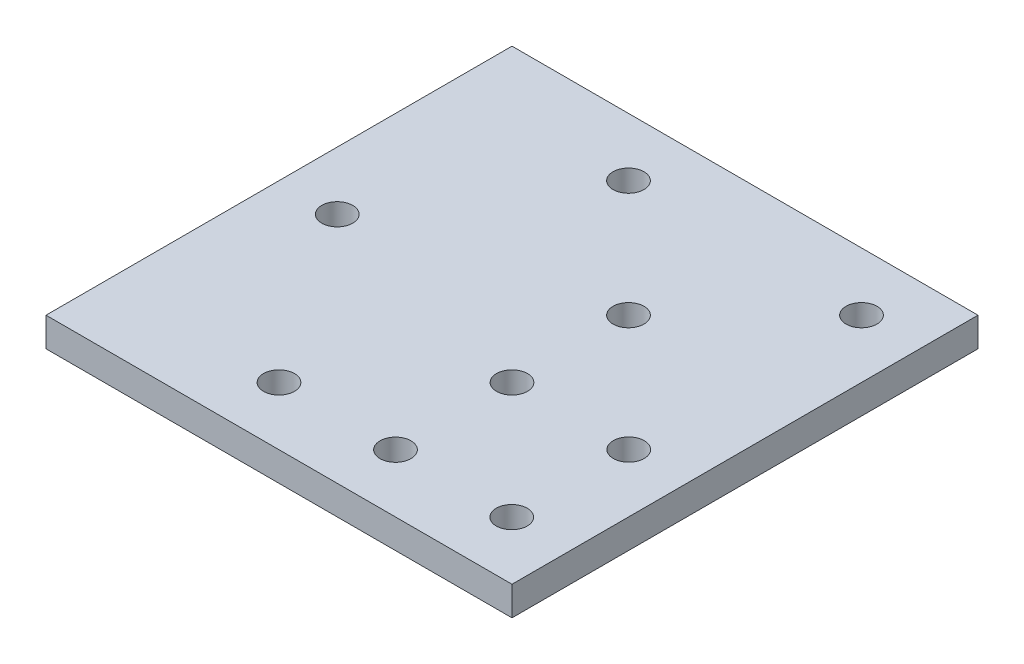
ISO-10303-21;
HEADER;
FILE_DESCRIPTION(('STEP AP214'),'2;1');
FILE_NAME('part.step','',(''),(''),'','','');
FILE_SCHEMA(('AUTOMOTIVE_DESIGN { 1 0 10303 214 1 1 1 1 }'));
ENDSEC;
DATA;
#1=APPLICATION_CONTEXT('core data for automotive mechanical design processes');
#2=APPLICATION_PROTOCOL_DEFINITION('international standard','automotive_design',2000,#1);
#3=PRODUCT_CONTEXT('',#1,'mechanical');
#4=PRODUCT('Part','Part','',(#3));
#5=PRODUCT_RELATED_PRODUCT_CATEGORY('part','',(#4));
#6=PRODUCT_DEFINITION_FORMATION('','',#4);
#7=PRODUCT_DEFINITION_CONTEXT('part definition',#1,'design');
#8=PRODUCT_DEFINITION('design','',#6,#7);
#9=PRODUCT_DEFINITION_SHAPE('','',#8);
#10=(LENGTH_UNIT() NAMED_UNIT(*) SI_UNIT(.MILLI.,.METRE.));
#11=(NAMED_UNIT(*) PLANE_ANGLE_UNIT() SI_UNIT($,.RADIAN.));
#12=(NAMED_UNIT(*) SI_UNIT($,.STERADIAN.) SOLID_ANGLE_UNIT());
#13=UNCERTAINTY_MEASURE_WITH_UNIT(LENGTH_MEASURE(1.E-05),#10,'distance_accuracy_value','');
#14=(GEOMETRIC_REPRESENTATION_CONTEXT(3) GLOBAL_UNCERTAINTY_ASSIGNED_CONTEXT((#13)) GLOBAL_UNIT_ASSIGNED_CONTEXT((#10,
#11,#12)) REPRESENTATION_CONTEXT('',''));
#15=CARTESIAN_POINT('',(0.,0.,0.));
#16=DIRECTION('',(0.,0.,1.));
#17=DIRECTION('',(1.,0.,0.));
#18=AXIS2_PLACEMENT_3D('',#15,#16,#17);
#19=CARTESIAN_POINT('',(0.,6.34999999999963,-101.6));
#20=DIRECTION('',(0.,-1.,0.));
#21=DIRECTION('',(0.,0.,-1.));
#22=AXIS2_PLACEMENT_3D('',#19,#20,#21);
#23=PLANE('',#22);
#24=CARTESIAN_POINT('',(38.1,6.34999999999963,-88.9));
#25=DIRECTION('',(0.,1.,0.));
#26=DIRECTION('',(0.,0.,-1.));
#27=AXIS2_PLACEMENT_3D('',#24,#25,#26);
#28=CIRCLE('',#27,3.37311999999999);
#29=CARTESIAN_POINT('',(38.1,6.34999999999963,-92.27312));
#30=VERTEX_POINT('',#29);
#31=EDGE_CURVE('E174',#30,#30,#28,.T.);
#32=ORIENTED_EDGE('',*,*,#31,.F.);
#33=EDGE_LOOP('',(#32));
#34=FACE_BOUND('',#33,.T.);
#35=CARTESIAN_POINT('',(88.9,6.35000000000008,-12.6465638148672));
#36=DIRECTION('',(0.,1.,0.));
#37=DIRECTION('',(0.,0.,-1.));
#38=AXIS2_PLACEMENT_3D('',#35,#36,#37);
#39=CIRCLE('',#38,3.37312000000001);
#40=CARTESIAN_POINT('',(88.9,6.35000000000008,-16.0196838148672));
#41=VERTEX_POINT('',#40);
#42=EDGE_CURVE('E186',#41,#41,#39,.T.);
#43=ORIENTED_EDGE('',*,*,#42,.F.);
#44=EDGE_LOOP('',(#43));
#45=FACE_BOUND('',#44,.T.);
#46=CARTESIAN_POINT('',(88.9,6.34999999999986,-88.8999999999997));
#47=DIRECTION('',(0.,1.,0.));
#48=DIRECTION('',(0.,0.,1.));
#49=AXIS2_PLACEMENT_3D('',#46,#47,#48);
#50=CIRCLE('',#49,3.37311999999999);
#51=CARTESIAN_POINT('',(88.9,6.34999999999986,-85.5268799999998));
#52=VERTEX_POINT('',#51);
#53=EDGE_CURVE('E198',#52,#52,#50,.T.);
#54=ORIENTED_EDGE('',*,*,#53,.F.);
#55=EDGE_LOOP('',(#54));
#56=FACE_BOUND('',#55,.T.);
#57=CARTESIAN_POINT('',(38.1,6.34999999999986,-12.6999999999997));
#58=DIRECTION('',(0.,1.,0.));
#59=DIRECTION('',(0.,0.,-1.));
#60=AXIS2_PLACEMENT_3D('',#57,#58,#59);
#61=CIRCLE('',#60,3.37312);
#62=CARTESIAN_POINT('',(38.1,6.34999999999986,-16.0731199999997));
#63=VERTEX_POINT('',#62);
#64=EDGE_CURVE('E210',#63,#63,#61,.T.);
#65=ORIENTED_EDGE('',*,*,#64,.F.);
#66=EDGE_LOOP('',(#65));
#67=FACE_BOUND('',#66,.T.);
#68=DIRECTION('',(0.,0.,1.));
#69=VECTOR('',#68,1.);
#70=CARTESIAN_POINT('',(0.,6.34999999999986,0.));
#71=LINE('',#70,#69);
#72=CARTESIAN_POINT('',(0.,6.34999999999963,-101.6));
#73=VERTEX_POINT('',#72);
#74=CARTESIAN_POINT('',(0.,6.34999999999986,0.));
#75=VERTEX_POINT('',#74);
#76=EDGE_CURVE('E47',#73,#75,#71,.T.);
#77=ORIENTED_EDGE('',*,*,#76,.T.);
#78=DIRECTION('',(1.,0.,0.));
#79=VECTOR('',#78,1.);
#80=CARTESIAN_POINT('',(0.,6.34999999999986,0.));
#81=LINE('',#80,#79);
#82=CARTESIAN_POINT('',(101.6,6.34999999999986,2.22044604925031E-13));
#83=VERTEX_POINT('',#82);
#84=EDGE_CURVE('E77',#75,#83,#81,.T.);
#85=ORIENTED_EDGE('',*,*,#84,.T.);
#86=DIRECTION('',(0.,0.,-1.));
#87=VECTOR('',#86,1.);
#88=CARTESIAN_POINT('',(101.6,6.34999999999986,2.22044604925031E-13));
#89=LINE('',#88,#87);
#90=CARTESIAN_POINT('',(101.6,6.34999999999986,-101.6));
#91=VERTEX_POINT('',#90);
#92=EDGE_CURVE('E81',#83,#91,#89,.T.);
#93=ORIENTED_EDGE('',*,*,#92,.T.);
#94=DIRECTION('',(-1.,0.,0.));
#95=VECTOR('',#94,1.);
#96=CARTESIAN_POINT('',(0.,6.34999999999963,-101.6));
#97=LINE('',#96,#95);
#98=EDGE_CURVE('E89',#91,#73,#97,.T.);
#99=ORIENTED_EDGE('',*,*,#98,.T.);
#100=EDGE_LOOP('',(#77,#85,#93,#99));
#101=FACE_BOUND('',#100,.T.);
#102=CARTESIAN_POINT('',(88.9000000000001,6.34999999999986,-38.1534361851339));
#103=DIRECTION('',(0.,1.,0.));
#104=DIRECTION('',(0.,0.,1.));
#105=AXIS2_PLACEMENT_3D('',#102,#103,#104);
#106=CIRCLE('',#105,3.37312000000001);
#107=CARTESIAN_POINT('',(88.9000000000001,6.34999999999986,-34.7803161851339));
#108=VERTEX_POINT('',#107);
#109=EDGE_CURVE('E96',#108,#108,#106,.T.);
#110=ORIENTED_EDGE('',*,*,#109,.F.);
#111=EDGE_LOOP('',(#110));
#112=FACE_BOUND('',#111,.T.);
#113=CARTESIAN_POINT('',(63.5000000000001,6.35000000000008,-12.6999999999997));
#114=DIRECTION('',(0.,1.,0.));
#115=DIRECTION('',(0.,0.,1.));
#116=AXIS2_PLACEMENT_3D('',#113,#114,#115);
#117=CIRCLE('',#116,3.37312);
#118=CARTESIAN_POINT('',(63.5000000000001,6.35000000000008,-9.32687999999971));
#119=VERTEX_POINT('',#118);
#120=EDGE_CURVE('E204',#119,#119,#117,.T.);
#121=ORIENTED_EDGE('',*,*,#120,.F.);
#122=EDGE_LOOP('',(#121));
#123=FACE_BOUND('',#122,.T.);
#124=CARTESIAN_POINT('',(63.5000000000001,6.34999999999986,-63.5000000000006));
#125=DIRECTION('',(0.,1.,0.));
#126=DIRECTION('',(0.,0.,1.));
#127=AXIS2_PLACEMENT_3D('',#124,#125,#126);
#128=CIRCLE('',#127,3.37311999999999);
#129=CARTESIAN_POINT('',(63.5000000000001,6.34999999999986,-60.1268800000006));
#130=VERTEX_POINT('',#129);
#131=EDGE_CURVE('E192',#130,#130,#128,.T.);
#132=ORIENTED_EDGE('',*,*,#131,.F.);
#133=EDGE_LOOP('',(#132));
#134=FACE_BOUND('',#133,.T.);
#135=CARTESIAN_POINT('',(63.5,6.34999999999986,-38.1000000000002));
#136=DIRECTION('',(0.,1.,0.));
#137=DIRECTION('',(0.,0.,-1.));
#138=AXIS2_PLACEMENT_3D('',#135,#136,#137);
#139=CIRCLE('',#138,3.37311999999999);
#140=CARTESIAN_POINT('',(63.5,6.34999999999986,-41.4731200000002));
#141=VERTEX_POINT('',#140);
#142=EDGE_CURVE('E180',#141,#141,#139,.T.);
#143=ORIENTED_EDGE('',*,*,#142,.F.);
#144=EDGE_LOOP('',(#143));
#145=FACE_BOUND('',#144,.T.);
#146=CARTESIAN_POINT('',(12.7,6.34999999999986,-50.8));
#147=DIRECTION('',(0.,1.,0.));
#148=DIRECTION('',(0.,0.,-1.));
#149=AXIS2_PLACEMENT_3D('',#146,#147,#148);
#150=CIRCLE('',#149,3.37312);
#151=CARTESIAN_POINT('',(12.7,6.34999999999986,-54.17312));
#152=VERTEX_POINT('',#151);
#153=EDGE_CURVE('E165',#152,#152,#150,.T.);
#154=ORIENTED_EDGE('',*,*,#153,.F.);
#155=EDGE_LOOP('',(#154));
#156=FACE_BOUND('',#155,.T.);
#157=ADVANCED_FACE('F30',(#34,#45,#56,#67,#101,#112,#123,#134,#145,#156),#23,.F.);
#158=CARTESIAN_POINT('',(0.,-2.22044604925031E-13,-101.6));
#159=DIRECTION('',(0.,-1.,0.));
#160=DIRECTION('',(0.,0.,-1.));
#161=AXIS2_PLACEMENT_3D('',#158,#159,#160);
#162=PLANE('',#161);
#163=CARTESIAN_POINT('',(38.1,-2.22044604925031E-13,-88.9));
#164=DIRECTION('',(0.,1.,0.));
#165=DIRECTION('',(0.,0.,-1.));
#166=AXIS2_PLACEMENT_3D('',#163,#164,#165);
#167=CIRCLE('',#166,3.37311999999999);
#168=CARTESIAN_POINT('',(38.1,-2.22138145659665E-13,-92.27312));
#169=VERTEX_POINT('',#168);
#170=EDGE_CURVE('E171',#169,#169,#167,.T.);
#171=ORIENTED_EDGE('',*,*,#170,.T.);
#172=EDGE_LOOP('',(#171));
#173=FACE_BOUND('',#172,.T.);
#174=CARTESIAN_POINT('',(88.9,0.,-12.6465638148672));
#175=DIRECTION('',(0.,1.,0.));
#176=DIRECTION('',(0.,0.,-1.));
#177=AXIS2_PLACEMENT_3D('',#174,#175,#176);
#178=CIRCLE('',#177,3.37312000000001);
#179=CARTESIAN_POINT('',(88.9,0.,-16.0196838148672));
#180=VERTEX_POINT('',#179);
#181=EDGE_CURVE('E183',#180,#180,#178,.T.);
#182=ORIENTED_EDGE('',*,*,#181,.T.);
#183=EDGE_LOOP('',(#182));
#184=FACE_BOUND('',#183,.T.);
#185=CARTESIAN_POINT('',(88.9,0.,-88.8999999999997));
#186=DIRECTION('',(0.,1.,0.));
#187=DIRECTION('',(0.,0.,1.));
#188=AXIS2_PLACEMENT_3D('',#185,#186,#187);
#189=CIRCLE('',#188,3.37311999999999);
#190=CARTESIAN_POINT('',(88.9,0.,-85.5268799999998));
#191=VERTEX_POINT('',#190);
#192=EDGE_CURVE('E195',#191,#191,#189,.T.);
#193=ORIENTED_EDGE('',*,*,#192,.T.);
#194=EDGE_LOOP('',(#193));
#195=FACE_BOUND('',#194,.T.);
#196=CARTESIAN_POINT('',(38.1,-2.22044604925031E-13,-12.6999999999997));
#197=DIRECTION('',(0.,1.,0.));
#198=DIRECTION('',(0.,0.,-1.));
#199=AXIS2_PLACEMENT_3D('',#196,#197,#198);
#200=CIRCLE('',#199,3.37312);
#201=CARTESIAN_POINT('',(38.1,-2.22138145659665E-13,-16.0731199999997));
#202=VERTEX_POINT('',#201);
#203=EDGE_CURVE('E207',#202,#202,#200,.T.);
#204=ORIENTED_EDGE('',*,*,#203,.T.);
#205=EDGE_LOOP('',(#204));
#206=FACE_BOUND('',#205,.T.);
#207=DIRECTION('',(1.,0.,0.));
#208=VECTOR('',#207,1.);
#209=CARTESIAN_POINT('',(0.,-2.22044604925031E-13,0.));
#210=LINE('',#209,#208);
#211=CARTESIAN_POINT('',(0.,-2.22044604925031E-13,0.));
#212=VERTEX_POINT('',#211);
#213=CARTESIAN_POINT('',(101.6,0.,2.22044604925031E-13));
#214=VERTEX_POINT('',#213);
#215=EDGE_CURVE('E85',#212,#214,#210,.T.);
#216=ORIENTED_EDGE('',*,*,#215,.F.);
#217=DIRECTION('',(0.,0.,1.));
#218=VECTOR('',#217,1.);
#219=CARTESIAN_POINT('',(0.,-2.22044604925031E-13,-50.7999999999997));
#220=LINE('',#219,#218);
#221=CARTESIAN_POINT('',(0.,-2.22044604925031E-13,-101.6));
#222=VERTEX_POINT('',#221);
#223=EDGE_CURVE('E99',#222,#212,#220,.T.);
#224=ORIENTED_EDGE('',*,*,#223,.F.);
#225=DIRECTION('',(-1.,0.,0.));
#226=VECTOR('',#225,1.);
#227=CARTESIAN_POINT('',(0.,-2.22044604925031E-13,-101.6));
#228=LINE('',#227,#226);
#229=CARTESIAN_POINT('',(101.6,-2.22044604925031E-13,-101.6));
#230=VERTEX_POINT('',#229);
#231=EDGE_CURVE('E71',#230,#222,#228,.T.);
#232=ORIENTED_EDGE('',*,*,#231,.F.);
#233=DIRECTION('',(0.,0.,-1.));
#234=VECTOR('',#233,1.);
#235=CARTESIAN_POINT('',(101.6,0.,-50.7999999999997));
#236=LINE('',#235,#234);
#237=EDGE_CURVE('E64',#214,#230,#236,.T.);
#238=ORIENTED_EDGE('',*,*,#237,.F.);
#239=EDGE_LOOP('',(#216,#224,#232,#238));
#240=FACE_BOUND('',#239,.T.);
#241=CARTESIAN_POINT('',(88.9000000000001,0.,-38.1534361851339));
#242=DIRECTION('',(0.,1.,0.));
#243=DIRECTION('',(0.,0.,1.));
#244=AXIS2_PLACEMENT_3D('',#241,#242,#243);
#245=CIRCLE('',#244,3.37312000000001);
#246=CARTESIAN_POINT('',(88.9000000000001,0.,-34.7803161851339));
#247=VERTEX_POINT('',#246);
#248=EDGE_CURVE('E213',#247,#247,#245,.T.);
#249=ORIENTED_EDGE('',*,*,#248,.T.);
#250=EDGE_LOOP('',(#249));
#251=FACE_BOUND('',#250,.T.);
#252=CARTESIAN_POINT('',(63.5000000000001,0.,-12.6999999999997));
#253=DIRECTION('',(0.,1.,0.));
#254=DIRECTION('',(0.,0.,1.));
#255=AXIS2_PLACEMENT_3D('',#252,#253,#254);
#256=CIRCLE('',#255,3.37312);
#257=CARTESIAN_POINT('',(63.5000000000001,0.,-9.32687999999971));
#258=VERTEX_POINT('',#257);
#259=EDGE_CURVE('E201',#258,#258,#256,.T.);
#260=ORIENTED_EDGE('',*,*,#259,.T.);
#261=EDGE_LOOP('',(#260));
#262=FACE_BOUND('',#261,.T.);
#263=CARTESIAN_POINT('',(63.5000000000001,0.,-63.5000000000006));
#264=DIRECTION('',(0.,1.,0.));
#265=DIRECTION('',(0.,0.,1.));
#266=AXIS2_PLACEMENT_3D('',#263,#264,#265);
#267=CIRCLE('',#266,3.37311999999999);
#268=CARTESIAN_POINT('',(63.5000000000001,0.,-60.1268800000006));
#269=VERTEX_POINT('',#268);
#270=EDGE_CURVE('E189',#269,#269,#267,.T.);
#271=ORIENTED_EDGE('',*,*,#270,.T.);
#272=EDGE_LOOP('',(#271));
#273=FACE_BOUND('',#272,.T.);
#274=CARTESIAN_POINT('',(63.5,0.,-38.1000000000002));
#275=DIRECTION('',(0.,1.,0.));
#276=DIRECTION('',(0.,0.,-1.));
#277=AXIS2_PLACEMENT_3D('',#274,#275,#276);
#278=CIRCLE('',#277,3.37311999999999);
#279=CARTESIAN_POINT('',(63.5,0.,-41.4731200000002));
#280=VERTEX_POINT('',#279);
#281=EDGE_CURVE('E177',#280,#280,#278,.T.);
#282=ORIENTED_EDGE('',*,*,#281,.T.);
#283=EDGE_LOOP('',(#282));
#284=FACE_BOUND('',#283,.T.);
#285=CARTESIAN_POINT('',(12.7,-2.22044604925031E-13,-50.8));
#286=DIRECTION('',(0.,1.,0.));
#287=DIRECTION('',(0.,0.,-1.));
#288=AXIS2_PLACEMENT_3D('',#285,#286,#287);
#289=CIRCLE('',#288,3.37312);
#290=CARTESIAN_POINT('',(12.7,-2.22138145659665E-13,-54.17312));
#291=VERTEX_POINT('',#290);
#292=EDGE_CURVE('E168',#291,#291,#289,.T.);
#293=ORIENTED_EDGE('',*,*,#292,.T.);
#294=EDGE_LOOP('',(#293));
#295=FACE_BOUND('',#294,.T.);
#296=ADVANCED_FACE('F105',(#173,#184,#195,#206,#240,#251,#262,#273,#284,#295),#162,.T.);
#297=CARTESIAN_POINT('',(0.,6.34999999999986,0.));
#298=DIRECTION('',(0.,0.,-1.));
#299=DIRECTION('',(-1.,0.,0.));
#300=AXIS2_PLACEMENT_3D('',#297,#298,#299);
#301=PLANE('',#300);
#302=ORIENTED_EDGE('',*,*,#215,.T.);
#303=DIRECTION('',(0.,-1.,0.));
#304=VECTOR('',#303,1.);
#305=CARTESIAN_POINT('',(101.6,6.34999999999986,2.22044604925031E-13));
#306=LINE('',#305,#304);
#307=EDGE_CURVE('E39',#83,#214,#306,.T.);
#308=ORIENTED_EDGE('',*,*,#307,.F.);
#309=ORIENTED_EDGE('',*,*,#84,.F.);
#310=DIRECTION('',(0.,-1.,0.));
#311=VECTOR('',#310,1.);
#312=CARTESIAN_POINT('',(0.,6.34999999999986,0.));
#313=LINE('',#312,#311);
#314=EDGE_CURVE('E11',#75,#212,#313,.T.);
#315=ORIENTED_EDGE('',*,*,#314,.T.);
#316=EDGE_LOOP('',(#302,#308,#309,#315));
#317=FACE_BOUND('',#316,.T.);
#318=ADVANCED_FACE('F32',(#317),#301,.F.);
#319=CARTESIAN_POINT('',(101.6,6.34999999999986,-50.7999999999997));
#320=DIRECTION('',(-1.,0.,0.));
#321=DIRECTION('',(0.,0.,1.));
#322=AXIS2_PLACEMENT_3D('',#319,#320,#321);
#323=PLANE('',#322);
#324=ORIENTED_EDGE('',*,*,#237,.T.);
#325=DIRECTION('',(0.,-1.,0.));
#326=VECTOR('',#325,1.);
#327=CARTESIAN_POINT('',(101.6,6.34999999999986,-101.6));
#328=LINE('',#327,#326);
#329=EDGE_CURVE('E86',#91,#230,#328,.T.);
#330=ORIENTED_EDGE('',*,*,#329,.F.);
#331=ORIENTED_EDGE('',*,*,#92,.F.);
#332=ORIENTED_EDGE('',*,*,#307,.T.);
#333=EDGE_LOOP('',(#324,#330,#331,#332));
#334=FACE_BOUND('',#333,.T.);
#335=ADVANCED_FACE('F87',(#334),#323,.F.);
#336=CARTESIAN_POINT('',(0.,6.34999999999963,-101.6));
#337=DIRECTION('',(0.,0.,1.));
#338=DIRECTION('',(1.,0.,0.));
#339=AXIS2_PLACEMENT_3D('',#336,#337,#338);
#340=PLANE('',#339);
#341=ORIENTED_EDGE('',*,*,#231,.T.);
#342=DIRECTION('',(0.,-1.,0.));
#343=VECTOR('',#342,1.);
#344=CARTESIAN_POINT('',(0.,6.34999999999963,-101.6));
#345=LINE('',#344,#343);
#346=EDGE_CURVE('E91',#73,#222,#345,.T.);
#347=ORIENTED_EDGE('',*,*,#346,.F.);
#348=ORIENTED_EDGE('',*,*,#98,.F.);
#349=ORIENTED_EDGE('',*,*,#329,.T.);
#350=EDGE_LOOP('',(#341,#347,#348,#349));
#351=FACE_BOUND('',#350,.T.);
#352=ADVANCED_FACE('F102',(#351),#340,.F.);
#353=CARTESIAN_POINT('',(0.,6.34999999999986,-50.7999999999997));
#354=DIRECTION('',(1.,0.,0.));
#355=DIRECTION('',(0.,0.,-1.));
#356=AXIS2_PLACEMENT_3D('',#353,#354,#355);
#357=PLANE('',#356);
#358=ORIENTED_EDGE('',*,*,#223,.T.);
#359=ORIENTED_EDGE('',*,*,#314,.F.);
#360=ORIENTED_EDGE('',*,*,#76,.F.);
#361=ORIENTED_EDGE('',*,*,#346,.T.);
#362=EDGE_LOOP('',(#358,#359,#360,#361));
#363=FACE_BOUND('',#362,.T.);
#364=ADVANCED_FACE('F107',(#363),#357,.F.);
#365=CARTESIAN_POINT('',(88.9000000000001,6.34999999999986,-38.1534361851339));
#366=DIRECTION('',(0.,-1.,0.));
#367=DIRECTION('',(0.,0.,-1.));
#368=AXIS2_PLACEMENT_3D('',#365,#366,#367);
#369=CYLINDRICAL_SURFACE('',#368,3.37312000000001);
#370=ORIENTED_EDGE('',*,*,#109,.T.);
#371=EDGE_LOOP('',(#370));
#372=FACE_BOUND('',#371,.T.);
#373=ORIENTED_EDGE('',*,*,#248,.F.);
#374=EDGE_LOOP('',(#373));
#375=FACE_BOUND('',#374,.T.);
#376=ADVANCED_FACE('F109',(#372,#375),#369,.F.);
#377=CARTESIAN_POINT('',(38.1,6.34999999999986,-12.6999999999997));
#378=DIRECTION('',(0.,-1.,0.));
#379=DIRECTION('',(0.,0.,-1.));
#380=AXIS2_PLACEMENT_3D('',#377,#378,#379);
#381=CYLINDRICAL_SURFACE('',#380,3.37312);
#382=ORIENTED_EDGE('',*,*,#64,.T.);
#383=EDGE_LOOP('',(#382));
#384=FACE_BOUND('',#383,.T.);
#385=ORIENTED_EDGE('',*,*,#203,.F.);
#386=EDGE_LOOP('',(#385));
#387=FACE_BOUND('',#386,.T.);
#388=ADVANCED_FACE('F115',(#384,#387),#381,.F.);
#389=CARTESIAN_POINT('',(63.5000000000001,6.35000000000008,-12.6999999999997));
#390=DIRECTION('',(0.,-1.,0.));
#391=DIRECTION('',(0.,0.,-1.));
#392=AXIS2_PLACEMENT_3D('',#389,#390,#391);
#393=CYLINDRICAL_SURFACE('',#392,3.37312);
#394=ORIENTED_EDGE('',*,*,#120,.T.);
#395=EDGE_LOOP('',(#394));
#396=FACE_BOUND('',#395,.T.);
#397=ORIENTED_EDGE('',*,*,#259,.F.);
#398=EDGE_LOOP('',(#397));
#399=FACE_BOUND('',#398,.T.);
#400=ADVANCED_FACE('F132',(#396,#399),#393,.F.);
#401=CARTESIAN_POINT('',(88.9,6.34999999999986,-88.8999999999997));
#402=DIRECTION('',(0.,-1.,0.));
#403=DIRECTION('',(0.,0.,-1.));
#404=AXIS2_PLACEMENT_3D('',#401,#402,#403);
#405=CYLINDRICAL_SURFACE('',#404,3.37311999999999);
#406=ORIENTED_EDGE('',*,*,#53,.T.);
#407=EDGE_LOOP('',(#406));
#408=FACE_BOUND('',#407,.T.);
#409=ORIENTED_EDGE('',*,*,#192,.F.);
#410=EDGE_LOOP('',(#409));
#411=FACE_BOUND('',#410,.T.);
#412=ADVANCED_FACE('F136',(#408,#411),#405,.F.);
#413=CARTESIAN_POINT('',(63.5000000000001,6.34999999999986,-63.5000000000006));
#414=DIRECTION('',(0.,-1.,0.));
#415=DIRECTION('',(0.,0.,-1.));
#416=AXIS2_PLACEMENT_3D('',#413,#414,#415);
#417=CYLINDRICAL_SURFACE('',#416,3.37311999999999);
#418=ORIENTED_EDGE('',*,*,#131,.T.);
#419=EDGE_LOOP('',(#418));
#420=FACE_BOUND('',#419,.T.);
#421=ORIENTED_EDGE('',*,*,#270,.F.);
#422=EDGE_LOOP('',(#421));
#423=FACE_BOUND('',#422,.T.);
#424=ADVANCED_FACE('F140',(#420,#423),#417,.F.);
#425=CARTESIAN_POINT('',(88.9,6.35000000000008,-12.6465638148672));
#426=DIRECTION('',(0.,-1.,0.));
#427=DIRECTION('',(0.,0.,-1.));
#428=AXIS2_PLACEMENT_3D('',#425,#426,#427);
#429=CYLINDRICAL_SURFACE('',#428,3.37312000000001);
#430=ORIENTED_EDGE('',*,*,#42,.T.);
#431=EDGE_LOOP('',(#430));
#432=FACE_BOUND('',#431,.T.);
#433=ORIENTED_EDGE('',*,*,#181,.F.);
#434=EDGE_LOOP('',(#433));
#435=FACE_BOUND('',#434,.T.);
#436=ADVANCED_FACE('F144',(#432,#435),#429,.F.);
#437=CARTESIAN_POINT('',(63.5,6.34999999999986,-38.1000000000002));
#438=DIRECTION('',(0.,-1.,0.));
#439=DIRECTION('',(0.,0.,-1.));
#440=AXIS2_PLACEMENT_3D('',#437,#438,#439);
#441=CYLINDRICAL_SURFACE('',#440,3.37311999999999);
#442=ORIENTED_EDGE('',*,*,#142,.T.);
#443=EDGE_LOOP('',(#442));
#444=FACE_BOUND('',#443,.T.);
#445=ORIENTED_EDGE('',*,*,#281,.F.);
#446=EDGE_LOOP('',(#445));
#447=FACE_BOUND('',#446,.T.);
#448=ADVANCED_FACE('F148',(#444,#447),#441,.F.);
#449=CARTESIAN_POINT('',(38.1,6.34999999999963,-88.9));
#450=DIRECTION('',(0.,-1.,0.));
#451=DIRECTION('',(0.,0.,-1.));
#452=AXIS2_PLACEMENT_3D('',#449,#450,#451);
#453=CYLINDRICAL_SURFACE('',#452,3.37311999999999);
#454=ORIENTED_EDGE('',*,*,#31,.T.);
#455=EDGE_LOOP('',(#454));
#456=FACE_BOUND('',#455,.T.);
#457=ORIENTED_EDGE('',*,*,#170,.F.);
#458=EDGE_LOOP('',(#457));
#459=FACE_BOUND('',#458,.T.);
#460=ADVANCED_FACE('F152',(#456,#459),#453,.F.);
#461=CARTESIAN_POINT('',(12.7,6.34999999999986,-50.8));
#462=DIRECTION('',(0.,-1.,0.));
#463=DIRECTION('',(0.,0.,-1.));
#464=AXIS2_PLACEMENT_3D('',#461,#462,#463);
#465=CYLINDRICAL_SURFACE('',#464,3.37312);
#466=ORIENTED_EDGE('',*,*,#153,.T.);
#467=EDGE_LOOP('',(#466));
#468=FACE_BOUND('',#467,.T.);
#469=ORIENTED_EDGE('',*,*,#292,.F.);
#470=EDGE_LOOP('',(#469));
#471=FACE_BOUND('',#470,.T.);
#472=ADVANCED_FACE('F156',(#468,#471),#465,.F.);
#473=CLOSED_SHELL('',(#157,#296,#318,#335,#352,#364,#376,#388,#400,#412,#424,#436,#448,#460,#472));
#474=MANIFOLD_SOLID_BREP('B2',#473);
#475=ADVANCED_BREP_SHAPE_REPRESENTATION('',(#18,#474),#14);
#476=SHAPE_DEFINITION_REPRESENTATION(#9,#475);
ENDSEC;
END-ISO-10303-21;
